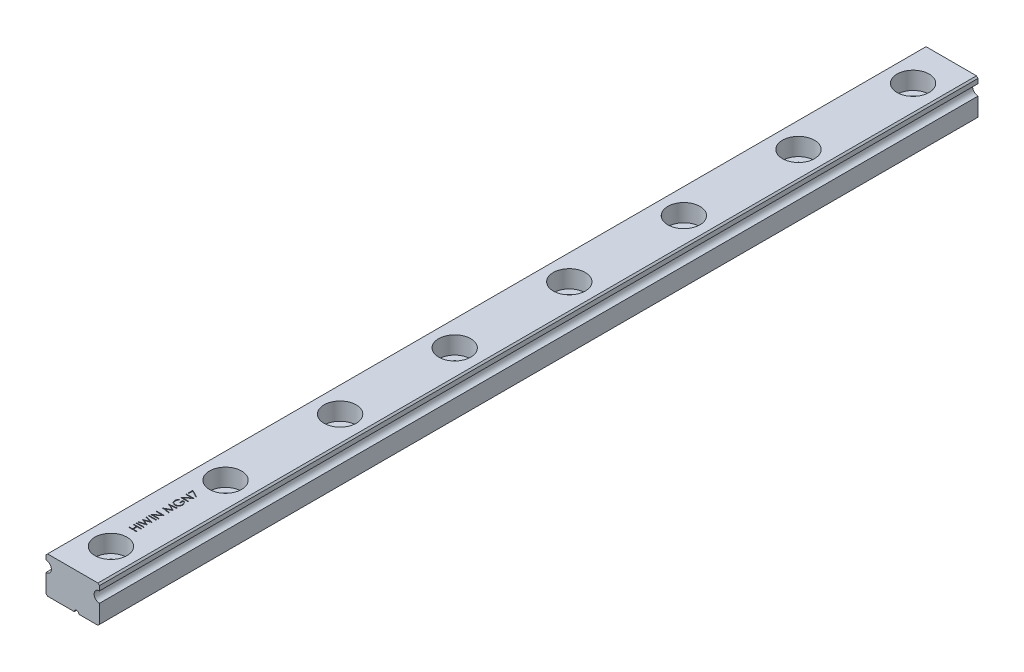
from build123d import *

# Parameters (mm, degrees)
EXTRUDE_1_DEPTH              = 115
HOLE_WIZARD_M2_1_D           = 2.4
HOLE_WIZARD_M2_1_CBORE_D     = 4.2
HOLE_WIZARD_M2_1_CBORE_DEPTH = 2.3
PATTERN_LINEAR_1_COUNT       = 8
PATTERN_LINEAR_1_PITCH       = 15
SKETCH_6_W                   = 1
SKETCH_6_H                   = 0.089743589
CUT_EXTRUDE_1_DEPTH          = 0.1


with BuildPart() as part:
    # Sketch 1 → Extrude 1 (new body)
    with BuildSketch(Plane.XY):
        with BuildLine():
            Line((-3.5, 4.6), (-3.5, 4))
            ThreePointArc((-3.5, 4), (-2.8, 3.3), (-3.5, 2.6))
            Line((-3.5, 2.6), (-3.5, 0.2))
            Line((-3.5, 0.2), (-3.3, 0))
            Line((-3.3, 0), (0.2, 0))
            ThreePointArc((0.2, 0), (0.5, 0.3), (0.8, 0))
            Line((0.8, 0), (3.3, 0))
            Line((3.3, 0), (3.5, 0.2))
            Line((3.5, 0.2), (3.5, 2.6))
            ThreePointArc((3.5, 2.6), (2.8, 3.3), (3.5, 4))
            Line((3.5, 4), (3.5, 4.6))
            Line((3.5, 4.6), (3.3, 4.8))
            Line((3.3, 4.8), (-3.3, 4.8))
            Line((-3.3, 4.8), (-3.5, 4.6))
        make_face()
    extrude(amount=-EXTRUDE_1_DEPTH)

    # Hole Wizard M2 _1 (through all)
    with Locations(Plane(origin=(1.647961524, 4.8, 19.977127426), x_dir=(-1, 0, 0), z_dir=(0, 1, 0))):
        with Locations((1.647961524, -24.977127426)):
            hole_wizard_m2_1 = CounterBoreHole(HOLE_WIZARD_M2_1_D / 2, HOLE_WIZARD_M2_1_CBORE_D / 2, HOLE_WIZARD_M2_1_CBORE_DEPTH)

    # Pattern Linear 1: Hole Wizard M2 _1 ×8
    with Locations(*[(0, 0, -i * PATTERN_LINEAR_1_PITCH) for i in range(1, PATTERN_LINEAR_1_COUNT)]):
        add(hole_wizard_m2_1, mode=Mode.SUBTRACT)

    # Sketch 6 → Cut-Extrude 1 (cut)
    with BuildSketch(Plane(origin=(0, 4.8, 0), x_dir=(1, 0, 0), z_dir=(0, 1, 0))):
        Polygon((-1, 8.326923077), (-1, 8.416666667), (-0.58974359, 8.416666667), (-0.58974359, 8.929487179), (-1, 8.929487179), (-1, 9.019230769), (0, 9.019230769), (0, 8.929487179), (-0.487179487, 8.929487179), (-0.487179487, 8.416666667), (0, 8.416666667), (0, 8.326923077), align=None)
        with Locations((-0.5, 9.32051282)):
            Rectangle(SKETCH_6_W, SKETCH_6_H)
        Polygon((-1, 9.519230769), (-1, 9.611979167), (-0.266626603, 9.807692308), (-1, 10.098758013), (-1, 10.111778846), (-0.271634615, 10.397435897), (-1, 10.594150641), (-1, 10.685897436), (0, 10.416266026), (0, 10.403445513), (-0.764823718, 10.102564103), (0, 9.798076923), (0, 9.78525641), align=None)
        with Locations((-0.5, 10.961538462)):
            Rectangle(SKETCH_6_W, SKETCH_6_H)
        Polygon((0, 11.224358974), (-1, 11.224358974), (-1, 11.243189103), (-0.212940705, 11.903846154), (-1, 11.903846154), (-1, 11.993589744), (0, 11.993589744), (0, 11.973157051), (-0.78525641, 11.314102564), (0, 11.314102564), align=None)
        Polygon((0, 12.583333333), (-1, 12.715344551), (-1, 12.728165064), (-0.179487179, 13.141025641), (-1, 13.552884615), (-1, 13.565905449), (0, 13.698717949), (0, 13.608573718), (-0.719551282, 13.512820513), (0, 13.151842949), (0, 13.131610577), (-0.721153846, 12.769230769), (0, 12.673677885), align=None)
        with BuildLine():
            Line((-0.829326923, 14.83974359), (-0.756410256, 14.762820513))
            add(Edge.make_bspline(
                [(-0.756410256, 14.762820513), (-0.769509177, 14.748903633), (-0.795394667, 14.721401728), (-0.828926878, 14.676487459), (-0.857936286, 14.629814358), (-0.881363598, 14.581306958), (-0.899741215, 14.532237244), (-0.913100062, 14.483448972), (-0.921560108, 14.435258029), (-0.922576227, 14.403211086), (-0.923076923, 14.387419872)],
                knots=[0, 0, 0, 0, 1.089067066, 2.152164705, 3.18986567, 4.218445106, 5.218487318, 6.173592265, 7.100032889, 8, 8, 8, 8], degree=3))
            add(Edge.make_bspline(
                [(-0.923076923, 14.387419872), (-0.92295875, 14.377729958), (-0.92272271, 14.35837526), (-0.919710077, 14.329626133), (-0.915377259, 14.301178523), (-0.909108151, 14.27308613), (-0.901162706, 14.245294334), (-0.891224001, 14.217899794), (-0.879636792, 14.190851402), (-0.8662475, 14.164403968), (-0.851539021, 14.138763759), (-0.835239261, 14.11454776), (-0.817871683, 14.091600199), (-0.798997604, 14.070357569), (-0.778802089, 14.050678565), (-0.757648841, 14.032201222), (-0.735121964, 14.015269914), (-0.711314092, 14.000188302), (-0.686779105, 13.98656899), (-0.661725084, 13.97479979), (-0.636384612, 13.964568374), (-0.61056688, 13.956775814), (-0.584538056, 13.950175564), (-0.558161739, 13.945580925), (-0.531369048, 13.942981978), (-0.513426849, 13.942533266), (-0.504407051, 13.942307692)],
                knots=[0, 0, 0, 0, 1.028150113, 2.053633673, 3.06513288, 4.081487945, 5.106702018, 6.131327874, 7.172780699, 8.228344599, 9.276313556, 10.308389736, 11.324843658, 12.329040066, 13.321460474, 14.316307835, 15.308626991, 16.309440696, 17.305625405, 18.28535951, 19.246194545, 20.203493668, 21.145557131, 22.095268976, 23.042464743, 24, 24, 24, 24], degree=3))
            add(Edge.make_bspline(
                [(-0.504407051, 13.942307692), (-0.495186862, 13.942523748), (-0.476771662, 13.94295527), (-0.449286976, 13.945713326), (-0.422213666, 13.950843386), (-0.395509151, 13.957646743), (-0.369120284, 13.966296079), (-0.343074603, 13.976922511), (-0.31737464, 13.989581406), (-0.292275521, 14.004201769), (-0.267846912, 14.020347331), (-0.244643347, 14.038104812), (-0.222934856, 14.057504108), (-0.202404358, 14.078189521), (-0.183181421, 14.10034952), (-0.165497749, 14.1241991), (-0.149079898, 14.149404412), (-0.134108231, 14.175976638), (-0.120734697, 14.203634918), (-0.108842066, 14.231993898), (-0.099047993, 14.261144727), (-0.091065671, 14.29093406), (-0.084522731, 14.321326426), (-0.08031345, 14.352476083), (-0.077258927, 14.384154), (-0.077035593, 14.405507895), (-0.076923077, 14.416266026)],
                knots=[0, 0, 0, 0, 0.935915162, 1.869274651, 2.799799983, 3.730201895, 4.664668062, 5.616159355, 6.583070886, 7.570012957, 8.562524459, 9.553461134, 10.53281078, 11.515274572, 12.509912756, 13.507571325, 14.526460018, 15.561318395, 16.601025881, 17.643204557, 18.680545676, 19.719612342, 20.772381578, 21.833430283, 22.908478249, 24, 24, 24, 24], degree=3))
            add(Edge.make_bspline(
                [(-0.076923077, 14.416266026), (-0.077193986, 14.429231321), (-0.077725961, 14.454690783), (-0.081870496, 14.492114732), (-0.088335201, 14.528061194), (-0.097832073, 14.562413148), (-0.109852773, 14.595295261), (-0.124718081, 14.626586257), (-0.142271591, 14.656372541), (-0.162157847, 14.684525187), (-0.184314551, 14.710374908), (-0.208010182, 14.733901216), (-0.233551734, 14.754295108), (-0.260558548, 14.77216577), (-0.28928895, 14.786936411), (-0.319583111, 14.799063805), (-0.351459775, 14.808358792), (-0.373485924, 14.812174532), (-0.384615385, 14.814102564)],
                knots=[0, 0, 0, 0, 1.130199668, 2.219330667, 3.279027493, 4.311506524, 5.322739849, 6.327972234, 7.327472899, 8.33386792, 9.329086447, 10.29244429, 11.240784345, 12.174119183, 13.111530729, 14.052100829, 15.015757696, 16, 16, 16, 16], degree=3))
            Line((-0.384615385, 14.814102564), (-0.384615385, 14.480769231))
            Line((-0.384615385, 14.480769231), (-0.487179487, 14.480769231))
            Line((-0.487179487, 14.480769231), (-0.487179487, 14.903846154))
            add(Edge.make_bspline(
                [(-0.487179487, 14.903846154), (-0.468063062, 14.903358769), (-0.430648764, 14.902404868), (-0.37608583, 14.895713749), (-0.32455106, 14.884909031), (-0.275990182, 14.870148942), (-0.230472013, 14.851041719), (-0.187950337, 14.827792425), (-0.148699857, 14.800028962), (-0.112400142, 14.768740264), (-0.080020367, 14.733625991), (-0.051561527, 14.695634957), (-0.027589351, 14.654704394), (-0.008086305, 14.610873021), (0.007134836, 14.564284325), (0.017926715, 14.514830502), (0.024392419, 14.462578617), (0.025218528, 14.426768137), (0.025641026, 14.408453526)],
                knots=[0, 0, 0, 0, 1.140356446, 2.231883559, 3.274166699, 4.278491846, 5.25512956, 6.21435461, 7.1637429, 8.11826594, 9.068280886, 10.0076534, 10.945064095, 11.891975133, 12.864533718, 13.863980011, 14.907571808, 16, 16, 16, 16], degree=3))
            add(Edge.make_bspline(
                [(0.025641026, 14.408453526), (0.02547842, 14.397164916), (0.025157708, 14.374900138), (0.022878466, 14.342017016), (0.01936973, 14.310040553), (0.014071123, 14.278975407), (0.007581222, 14.24870731), (-0.000729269, 14.219387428), (-0.010348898, 14.190904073), (-0.021290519, 14.16321322), (-0.033968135, 14.136566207), (-0.048056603, 14.110844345), (-0.063483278, 14.085905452), (-0.080514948, 14.061919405), (-0.099024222, 14.038761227), (-0.119048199, 14.016580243), (-0.140525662, 13.995252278), (-0.155776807, 13.981892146), (-0.163461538, 13.975160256)],
                knots=[0, 0, 0, 0, 1.107784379, 2.184907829, 3.233506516, 4.263428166, 5.276301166, 6.270063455, 7.25232949, 8.225834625, 9.190232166, 10.146266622, 11.1027726, 12.066435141, 13.031522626, 14.010570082, 14.99756817, 16, 16, 16, 16], degree=3))
            add(Edge.make_bspline(
                [(-0.163461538, 13.975160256), (-0.175653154, 13.965392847), (-0.199834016, 13.946020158), (-0.238576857, 13.921083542), (-0.278691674, 13.899825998), (-0.320290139, 13.882578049), (-0.363333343, 13.869110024), (-0.407766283, 13.859451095), (-0.453646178, 13.853791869), (-0.484693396, 13.852976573), (-0.500400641, 13.852564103)],
                knots=[0, 0, 0, 0, 1.023165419, 2.029347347, 3.013907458, 3.994755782, 4.975994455, 5.96558838, 6.970761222, 8, 8, 8, 8], degree=3))
            add(Edge.make_bspline(
                [(-0.500400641, 13.852564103), (-0.512162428, 13.852716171), (-0.535536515, 13.853018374), (-0.570238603, 13.856682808), (-0.604324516, 13.861940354), (-0.637766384, 13.86966809), (-0.670586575, 13.879409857), (-0.702800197, 13.89156808), (-0.734426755, 13.905723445), (-0.765246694, 13.92217765), (-0.794858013, 13.940483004), (-0.823115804, 13.960370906), (-0.849562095, 13.981994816), (-0.874258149, 14.0054177), (-0.897569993, 14.030167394), (-0.919010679, 14.05676348), (-0.938915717, 14.084803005), (-0.956902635, 14.11450333), (-0.973064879, 14.145395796), (-0.987232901, 14.177413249), (-0.998942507, 14.210544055), (-1.008877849, 14.244540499), (-1.016225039, 14.279659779), (-1.02155325, 14.315647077), (-1.025199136, 14.352689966), (-1.025492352, 14.377728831), (-1.025641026, 14.390424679)],
                knots=[0, 0, 0, 0, 1.00895651, 2.005089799, 2.991467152, 3.967318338, 4.948153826, 5.927364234, 6.919980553, 7.91976625, 8.923240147, 9.905815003, 10.88314567, 11.851989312, 12.825009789, 13.798721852, 14.781296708, 15.773896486, 16.776076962, 17.771600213, 18.775744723, 19.78957137, 20.808953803, 21.851964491, 22.910847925, 24, 24, 24, 24], degree=3))
            add(Edge.make_bspline(
                [(-1.025641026, 14.390424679), (-1.025475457, 14.400778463), (-1.025147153, 14.4213088), (-1.022871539, 14.451859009), (-1.019264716, 14.481937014), (-1.014342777, 14.511587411), (-1.007638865, 14.54070923), (-0.999616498, 14.569385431), (-0.990275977, 14.597657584), (-0.979136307, 14.625437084), (-0.966492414, 14.652910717), (-0.952260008, 14.680231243), (-0.936195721, 14.707305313), (-0.918251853, 14.73417988), (-0.898736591, 14.76102441), (-0.877091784, 14.787414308), (-0.854170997, 14.813986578), (-0.837690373, 14.831072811), (-0.829326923, 14.83974359)],
                knots=[0, 0, 0, 0, 0.985871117, 1.954866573, 2.915460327, 3.869826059, 4.81536089, 5.759505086, 6.70452669, 7.649098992, 8.607881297, 9.583363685, 10.581137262, 11.603961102, 12.659522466, 13.73993555, 14.853081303, 16, 16, 16, 16], degree=3))
        make_face()
        Polygon((0, 15.108974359), (-1, 15.108974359), (-1, 15.127804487), (-0.212940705, 15.788461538), (-1, 15.788461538), (-1, 15.878205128), (0, 15.878205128), (0, 15.857772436), (-0.78525641, 15.198717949), (0, 15.198717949), align=None)
        Polygon((-1, 16.108974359), (-1, 16.724358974), (0.025641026, 16.198717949), (-0.017027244, 16.12119391), (-0.897435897, 16.572516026), (-0.897435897, 16.108974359), align=None)
    extrude(amount=-CUT_EXTRUDE_1_DEPTH, mode=Mode.SUBTRACT)


solid = part.part
